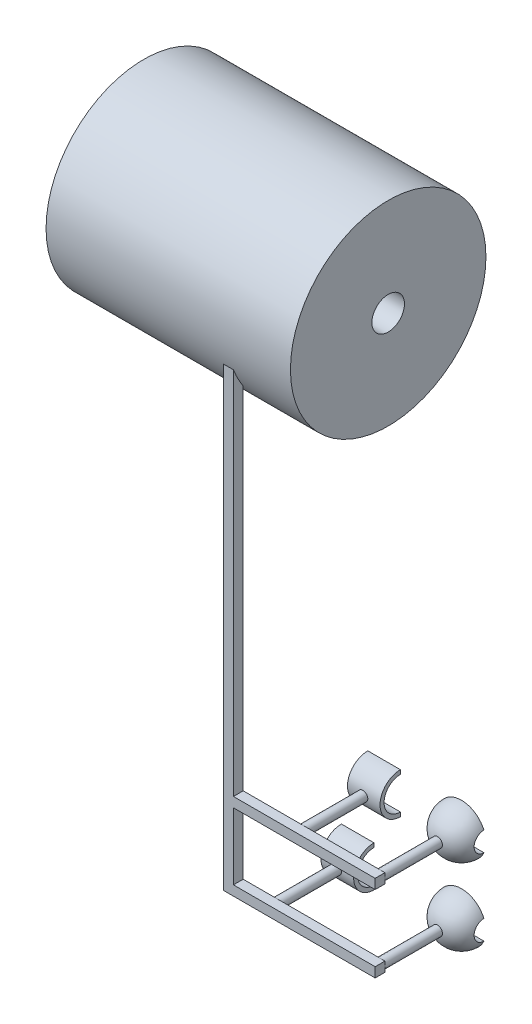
from build123d import *

# Parameters (mm, degrees)
R_VOLUTION1_ANGLE            = 180
ESQUISSE2_W                  = 20
ESQUISSE2_H                  = 2.5
R_VOLUTION3_ANGLE            = 180
R_VOLUTION4_ANGLE            = 180
ESQUISSE4_W                  = 20
ESQUISSE4_H                  = 2.5
R_VOLUTION5_ANGLE            = 180
ESQUISSE5_W                  = 150
ESQUISSE5_H                  = 60
ESQUISSE6_R                  = 10
ENL_V_MAT_EXTRU_1_DEPTH      = 20
ESQUISSE7_R                  = 3
EXTRUSION2_DEPTH             = 37
EXTRUSION3_DEPTH             = 6
ENL_V_MAT_EXTRU_2_DEPTH      = 373.258346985
ENL_V_MAT_EXTRU_2_DEPTH_BACK = 373.258346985
ESQUISSE9_R                  = 6


with BuildPart() as part:
    # Esquisse1 → R_volution1 (revolve)
    with BuildSketch(Plane.XY):
        with BuildLine():
            Line((0, 10), (0, 15))
            ThreePointArc((0, 15), (-15, 0), (0, -15))
            Line((0, -15), (0, -10))
            ThreePointArc((0, -10), (-10, 0), (0, 10))
        make_face()
    revolve(axis=Axis((0, 10, 0), (0, 1, 0)), revolution_arc=R_VOLUTION1_ANGLE)



with BuildPart() as body_2:
    # Esquisse2 → R_volution3 (revolve)
    with BuildSketch(Plane.XY):
        with Locations((-47.5, 11.25)):
            Rectangle(ESQUISSE2_W, ESQUISSE2_H)
    revolve(axis=Axis((0, 0, 0), (1, 0, 0)), revolution_arc=R_VOLUTION3_ANGLE)


with BuildPart() as body_3:
    # Esquisse3 → R_volution4 (revolve)
    with BuildSketch(Plane.XY):
        with BuildLine():
            Line((0, -37), (0, -32))
            ThreePointArc((0, -32), (15, -47), (0, -62))
            Line((0, -62), (0, -57))
            ThreePointArc((0, -57), (10, -47), (0, -37))
        make_face()
    revolve(axis=Axis((0, 0, 0), (0, -1, 0)), revolution_arc=R_VOLUTION4_ANGLE)


with BuildPart() as body_4:
    # Esquisse4 → R_volution5 (revolve)
    with BuildSketch(Plane.XY):
        with Locations((-63.7, -35.75)):
            Rectangle(ESQUISSE4_W, ESQUISSE4_H)
    revolve(axis=Axis((0, -47, 0), (1, 0, 0)), revolution_arc=R_VOLUTION5_ANGLE)


with BuildPart() as body_5:
    # Esquisse5 → R_volution6 (revolve)
    with BuildSketch(Plane.XY, mode=Mode.PRIVATE) as r_volution6_sk:
        with Locations((-120, 281.37)):
            Rectangle(ESQUISSE5_W, ESQUISSE5_H)
    revolve(r_volution6_sk.sketch.rotate(Axis((0, 251.37, 0), (-1, 0, 0)), 90), axis=Axis((0, 251.37, 0), (-1, 0, 0)))

    # Esquisse6 → Enl_v. mat.-Extru.1 (cut)
    with BuildSketch(Plane(origin=(-45, 0, 0), x_dir=(0, 0, -1), z_dir=(1, 0, 0))):
        with Locations((0, 251.37)):
            Circle(ESQUISSE6_R)
    extrude(amount=-ENL_V_MAT_EXTRU_1_DEPTH, mode=Mode.SUBTRACT)


with BuildPart() as part_1:
    add(part.part)

    add(body_3.part)  # Extrusion2 merges body 3
    # Esquisse7 → Extrusion2 (add)
    with BuildSketch(Plane.XY.offset(50)):
        Circle(ESQUISSE7_R)
        with Locations((0, -47)):
            Circle(ESQUISSE7_R)
        with Locations((-63.7, -47)):
            Circle(ESQUISSE7_R)
        with Locations((-47.5, 0)):
            Circle(ESQUISSE7_R)
    extrude(amount=-EXTRUSION2_DEPTH)


    add(body_5.part)  # Extrusion3 merges body 5
    # Esquisse8 → Extrusion3 (add)
    with BuildSketch(Plane.XY.offset(50)):
        Polygon((-84, 3), (-84, 251.37), (-90, 251.37), (-90, -50), (3, -50), (3, -44), (-84, -44), (-84, -3), (3, -3), (3, 3), align=None)
    extrude(amount=EXTRUSION3_DEPTH)

    # Esquisse9 → Enl_v. mat.-Extru.2 (cut, two sides: drawn at the far end of the back side and taken through both)
    with BuildSketch(Plane(origin=(0, 0, 0), x_dir=(0, 0, -1), z_dir=(1, 0, 0)).offset(-ENL_V_MAT_EXTRU_2_DEPTH_BACK)):
        Circle(ESQUISSE9_R)
        with Locations((0, -47)):
            Circle(ESQUISSE9_R)
    extrude(amount=ENL_V_MAT_EXTRU_2_DEPTH + ENL_V_MAT_EXTRU_2_DEPTH_BACK, mode=Mode.SUBTRACT)


solid = Compound([body_2.part, body_4.part, part_1.part])
